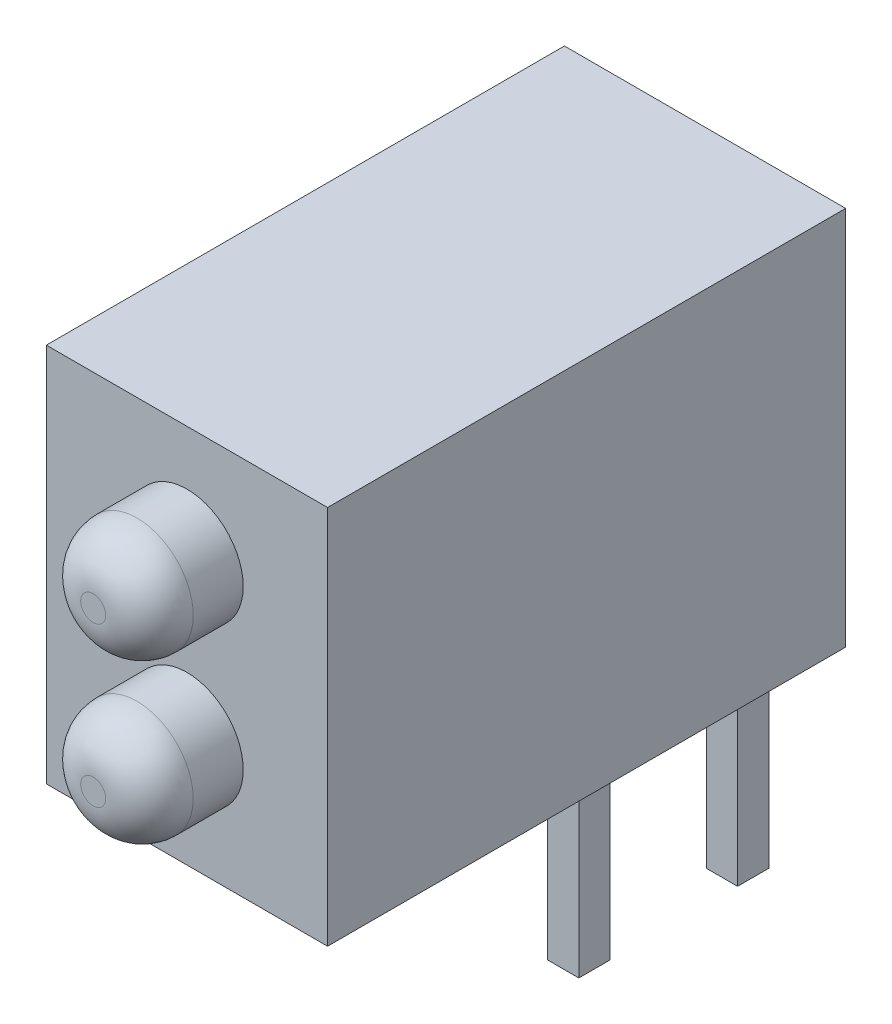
ISO-10303-21;
HEADER;
FILE_DESCRIPTION(('STEP AP214'),'2;1');
FILE_NAME('part.step','',(''),(''),'','','');
FILE_SCHEMA(('AUTOMOTIVE_DESIGN { 1 0 10303 214 1 1 1 1 }'));
ENDSEC;
DATA;
#1=APPLICATION_CONTEXT('core data for automotive mechanical design processes');
#2=APPLICATION_PROTOCOL_DEFINITION('international standard','automotive_design',2000,#1);
#3=PRODUCT_CONTEXT('',#1,'mechanical');
#4=PRODUCT('Part','Part','',(#3));
#5=PRODUCT_RELATED_PRODUCT_CATEGORY('part','',(#4));
#6=PRODUCT_DEFINITION_FORMATION('','',#4);
#7=PRODUCT_DEFINITION_CONTEXT('part definition',#1,'design');
#8=PRODUCT_DEFINITION('design','',#6,#7);
#9=PRODUCT_DEFINITION_SHAPE('','',#8);
#10=(LENGTH_UNIT() NAMED_UNIT(*) SI_UNIT(.MILLI.,.METRE.));
#11=(NAMED_UNIT(*) PLANE_ANGLE_UNIT() SI_UNIT($,.RADIAN.));
#12=(NAMED_UNIT(*) SI_UNIT($,.STERADIAN.) SOLID_ANGLE_UNIT());
#13=UNCERTAINTY_MEASURE_WITH_UNIT(LENGTH_MEASURE(1.E-05),#10,'distance_accuracy_value','');
#14=(GEOMETRIC_REPRESENTATION_CONTEXT(3) GLOBAL_UNCERTAINTY_ASSIGNED_CONTEXT((#13)) GLOBAL_UNIT_ASSIGNED_CONTEXT((#10,
#11,#12)) REPRESENTATION_CONTEXT('',''));
#15=CARTESIAN_POINT('',(0.,0.,0.));
#16=DIRECTION('',(0.,0.,1.));
#17=DIRECTION('',(1.,0.,0.));
#18=AXIS2_PLACEMENT_3D('',#15,#16,#17);
#19=CARTESIAN_POINT('',(-2.25,-3.04,-8.29));
#20=DIRECTION('',(0.,-1.,0.));
#21=DIRECTION('',(0.,0.,-1.));
#22=AXIS2_PLACEMENT_3D('',#19,#20,#21);
#23=PLANE('',#22);
#24=DIRECTION('',(-1.,0.,0.));
#25=VECTOR('',#24,1.);
#26=CARTESIAN_POINT('',(-1.52,-3.04,-4.75));
#27=LINE('',#26,#25);
#28=CARTESIAN_POINT('',(-1.02,-3.04,-4.75));
#29=VERTEX_POINT('',#28);
#30=CARTESIAN_POINT('',(-1.52,-3.04,-4.75));
#31=VERTEX_POINT('',#30);
#32=EDGE_CURVE('E198',#29,#31,#27,.T.);
#33=ORIENTED_EDGE('',*,*,#32,.F.);
#34=DIRECTION('',(0.,0.,1.));
#35=VECTOR('',#34,1.);
#36=CARTESIAN_POINT('',(-1.02,-3.04,-4.75));
#37=LINE('',#36,#35);
#38=CARTESIAN_POINT('',(-1.02,-3.04,-5.25));
#39=VERTEX_POINT('',#38);
#40=EDGE_CURVE('E195',#39,#29,#37,.T.);
#41=ORIENTED_EDGE('',*,*,#40,.F.);
#42=DIRECTION('',(1.,0.,0.));
#43=VECTOR('',#42,1.);
#44=CARTESIAN_POINT('',(-1.52,-3.04,-5.25));
#45=LINE('',#44,#43);
#46=CARTESIAN_POINT('',(-1.52,-3.04,-5.25));
#47=VERTEX_POINT('',#46);
#48=EDGE_CURVE('E207',#47,#39,#45,.T.);
#49=ORIENTED_EDGE('',*,*,#48,.F.);
#50=DIRECTION('',(0.,0.,-1.));
#51=VECTOR('',#50,1.);
#52=CARTESIAN_POINT('',(-1.52,-3.04,-4.75));
#53=LINE('',#52,#51);
#54=EDGE_CURVE('E215',#31,#47,#53,.T.);
#55=ORIENTED_EDGE('',*,*,#54,.F.);
#56=EDGE_LOOP('',(#33,#41,#49,#55));
#57=FACE_BOUND('',#56,.T.);
#58=DIRECTION('',(-1.,0.,0.));
#59=VECTOR('',#58,1.);
#60=CARTESIAN_POINT('',(-1.52,-3.04,-7.29));
#61=LINE('',#60,#59);
#62=CARTESIAN_POINT('',(-1.02,-3.04,-7.29));
#63=VERTEX_POINT('',#62);
#64=CARTESIAN_POINT('',(-1.52,-3.04,-7.29));
#65=VERTEX_POINT('',#64);
#66=EDGE_CURVE('E269',#63,#65,#61,.T.);
#67=ORIENTED_EDGE('',*,*,#66,.F.);
#68=DIRECTION('',(0.,0.,1.));
#69=VECTOR('',#68,1.);
#70=CARTESIAN_POINT('',(-1.02,-3.04,-7.29));
#71=LINE('',#70,#69);
#72=CARTESIAN_POINT('',(-1.02,-3.04,-7.79));
#73=VERTEX_POINT('',#72);
#74=EDGE_CURVE('E255',#73,#63,#71,.T.);
#75=ORIENTED_EDGE('',*,*,#74,.F.);
#76=DIRECTION('',(1.,0.,0.));
#77=VECTOR('',#76,1.);
#78=CARTESIAN_POINT('',(-1.52,-3.04,-7.79));
#79=LINE('',#78,#77);
#80=CARTESIAN_POINT('',(-1.52,-3.04,-7.79));
#81=VERTEX_POINT('',#80);
#82=EDGE_CURVE('E260',#81,#73,#79,.T.);
#83=ORIENTED_EDGE('',*,*,#82,.F.);
#84=DIRECTION('',(0.,0.,-1.));
#85=VECTOR('',#84,1.);
#86=CARTESIAN_POINT('',(-1.52,-3.04,-7.29));
#87=LINE('',#86,#85);
#88=EDGE_CURVE('E271',#65,#81,#87,.T.);
#89=ORIENTED_EDGE('',*,*,#88,.F.);
#90=EDGE_LOOP('',(#67,#75,#83,#89));
#91=FACE_BOUND('',#90,.T.);
#92=DIRECTION('',(1.,0.,0.));
#93=VECTOR('',#92,1.);
#94=CARTESIAN_POINT('',(-2.25,-3.04,0.));
#95=LINE('',#94,#93);
#96=CARTESIAN_POINT('',(-2.25,-3.04,0.));
#97=VERTEX_POINT('',#96);
#98=CARTESIAN_POINT('',(2.25,-3.04,0.));
#99=VERTEX_POINT('',#98);
#100=EDGE_CURVE('E295',#97,#99,#95,.T.);
#101=ORIENTED_EDGE('',*,*,#100,.F.);
#102=DIRECTION('',(0.,0.,1.));
#103=VECTOR('',#102,1.);
#104=CARTESIAN_POINT('',(-2.25,-3.04,-8.29));
#105=LINE('',#104,#103);
#106=CARTESIAN_POINT('',(-2.25,-3.04,-8.29));
#107=VERTEX_POINT('',#106);
#108=EDGE_CURVE('E318',#107,#97,#105,.T.);
#109=ORIENTED_EDGE('',*,*,#108,.F.);
#110=DIRECTION('',(1.,0.,0.));
#111=VECTOR('',#110,1.);
#112=CARTESIAN_POINT('',(-2.25,-3.04,-8.29));
#113=LINE('',#112,#111);
#114=CARTESIAN_POINT('',(2.25,-3.04,-8.29));
#115=VERTEX_POINT('',#114);
#116=EDGE_CURVE('E301',#107,#115,#113,.T.);
#117=ORIENTED_EDGE('',*,*,#116,.T.);
#118=DIRECTION('',(0.,0.,1.));
#119=VECTOR('',#118,1.);
#120=CARTESIAN_POINT('',(2.25,-3.04,-8.29));
#121=LINE('',#120,#119);
#122=EDGE_CURVE('E315',#115,#99,#121,.T.);
#123=ORIENTED_EDGE('',*,*,#122,.T.);
#124=EDGE_LOOP('',(#101,#109,#117,#123));
#125=FACE_BOUND('',#124,.T.);
#126=DIRECTION('',(-1.,0.,0.));
#127=VECTOR('',#126,1.);
#128=CARTESIAN_POINT('',(1.02,-3.04,-7.29));
#129=LINE('',#128,#127);
#130=CARTESIAN_POINT('',(1.52,-3.04,-7.29));
#131=VERTEX_POINT('',#130);
#132=CARTESIAN_POINT('',(1.02,-3.04,-7.29));
#133=VERTEX_POINT('',#132);
#134=EDGE_CURVE('E240',#131,#133,#129,.T.);
#135=ORIENTED_EDGE('',*,*,#134,.F.);
#136=DIRECTION('',(0.,0.,1.));
#137=VECTOR('',#136,1.);
#138=CARTESIAN_POINT('',(1.52,-3.04,-7.29));
#139=LINE('',#138,#137);
#140=CARTESIAN_POINT('',(1.52,-3.04,-7.79));
#141=VERTEX_POINT('',#140);
#142=EDGE_CURVE('E226',#141,#131,#139,.T.);
#143=ORIENTED_EDGE('',*,*,#142,.F.);
#144=DIRECTION('',(1.,0.,0.));
#145=VECTOR('',#144,1.);
#146=CARTESIAN_POINT('',(1.02,-3.04,-7.79));
#147=LINE('',#146,#145);
#148=CARTESIAN_POINT('',(1.02,-3.04,-7.79));
#149=VERTEX_POINT('',#148);
#150=EDGE_CURVE('E231',#149,#141,#147,.T.);
#151=ORIENTED_EDGE('',*,*,#150,.F.);
#152=DIRECTION('',(0.,0.,-1.));
#153=VECTOR('',#152,1.);
#154=CARTESIAN_POINT('',(1.02,-3.04,-7.29));
#155=LINE('',#154,#153);
#156=EDGE_CURVE('E242',#133,#149,#155,.T.);
#157=ORIENTED_EDGE('',*,*,#156,.F.);
#158=EDGE_LOOP('',(#135,#143,#151,#157));
#159=FACE_BOUND('',#158,.T.);
#160=DIRECTION('',(-1.,0.,0.));
#161=VECTOR('',#160,1.);
#162=CARTESIAN_POINT('',(1.02,-3.04,-4.75));
#163=LINE('',#162,#161);
#164=CARTESIAN_POINT('',(1.52,-3.04,-4.75));
#165=VERTEX_POINT('',#164);
#166=CARTESIAN_POINT('',(1.02,-3.04,-4.75));
#167=VERTEX_POINT('',#166);
#168=EDGE_CURVE('E672',#165,#167,#163,.T.);
#169=ORIENTED_EDGE('',*,*,#168,.F.);
#170=DIRECTION('',(0.,0.,1.));
#171=VECTOR('',#170,1.);
#172=CARTESIAN_POINT('',(1.52,-3.04,-4.75));
#173=LINE('',#172,#171);
#174=CARTESIAN_POINT('',(1.52,-3.04,-5.25));
#175=VERTEX_POINT('',#174);
#176=EDGE_CURVE('E193',#175,#165,#173,.T.);
#177=ORIENTED_EDGE('',*,*,#176,.F.);
#178=DIRECTION('',(1.,0.,0.));
#179=VECTOR('',#178,1.);
#180=CARTESIAN_POINT('',(1.02,-3.04,-5.25));
#181=LINE('',#180,#179);
#182=CARTESIAN_POINT('',(1.02,-3.04,-5.25));
#183=VERTEX_POINT('',#182);
#184=EDGE_CURVE('E189',#183,#175,#181,.T.);
#185=ORIENTED_EDGE('',*,*,#184,.F.);
#186=DIRECTION('',(0.,0.,-1.));
#187=VECTOR('',#186,1.);
#188=CARTESIAN_POINT('',(1.02,-3.04,-4.75));
#189=LINE('',#188,#187);
#190=EDGE_CURVE('E669',#167,#183,#189,.T.);
#191=ORIENTED_EDGE('',*,*,#190,.F.);
#192=EDGE_LOOP('',(#169,#177,#185,#191));
#193=FACE_BOUND('',#192,.T.);
#194=ADVANCED_FACE('F32',(#57,#91,#125,#159,#193),#23,.T.);
#195=CARTESIAN_POINT('',(2.25,-3.04,0.));
#196=DIRECTION('',(0.,0.,1.));
#197=DIRECTION('',(1.,0.,0.));
#198=AXIS2_PLACEMENT_3D('',#195,#196,#197);
#199=PLANE('',#198);
#200=CARTESIAN_POINT('',(0.,1.27,0.));
#201=DIRECTION('',(0.,0.,1.));
#202=DIRECTION('',(1.,0.,0.));
#203=AXIS2_PLACEMENT_3D('',#200,#201,#202);
#204=CIRCLE('',#203,0.9);
#205=CARTESIAN_POINT('',(0.9,1.27,0.));
#206=VERTEX_POINT('',#205);
#207=EDGE_CURVE('E287',#206,#206,#204,.T.);
#208=ORIENTED_EDGE('',*,*,#207,.F.);
#209=EDGE_LOOP('',(#208));
#210=FACE_BOUND('',#209,.T.);
#211=DIRECTION('',(0.,1.,0.));
#212=VECTOR('',#211,1.);
#213=CARTESIAN_POINT('',(2.25,3.04,0.));
#214=LINE('',#213,#212);
#215=CARTESIAN_POINT('',(2.25,3.04,0.));
#216=VERTEX_POINT('',#215);
#217=EDGE_CURVE('E290',#99,#216,#214,.T.);
#218=ORIENTED_EDGE('',*,*,#217,.T.);
#219=DIRECTION('',(-1.,0.,0.));
#220=VECTOR('',#219,1.);
#221=CARTESIAN_POINT('',(-2.25,3.04,0.));
#222=LINE('',#221,#220);
#223=CARTESIAN_POINT('',(-2.25,3.04,0.));
#224=VERTEX_POINT('',#223);
#225=EDGE_CURVE('E307',#216,#224,#222,.T.);
#226=ORIENTED_EDGE('',*,*,#225,.T.);
#227=DIRECTION('',(0.,-1.,0.));
#228=VECTOR('',#227,1.);
#229=CARTESIAN_POINT('',(-2.25,3.04,0.));
#230=LINE('',#229,#228);
#231=EDGE_CURVE('E310',#224,#97,#230,.T.);
#232=ORIENTED_EDGE('',*,*,#231,.T.);
#233=ORIENTED_EDGE('',*,*,#100,.T.);
#234=EDGE_LOOP('',(#218,#226,#232,#233));
#235=FACE_BOUND('',#234,.T.);
#236=CARTESIAN_POINT('',(0.,-1.27,0.));
#237=DIRECTION('',(0.,0.,1.));
#238=DIRECTION('',(1.,0.,0.));
#239=AXIS2_PLACEMENT_3D('',#236,#237,#238);
#240=CIRCLE('',#239,0.9);
#241=CARTESIAN_POINT('',(0.9,-1.27,0.));
#242=VERTEX_POINT('',#241);
#243=EDGE_CURVE('E284',#242,#242,#240,.T.);
#244=ORIENTED_EDGE('',*,*,#243,.F.);
#245=EDGE_LOOP('',(#244));
#246=FACE_BOUND('',#245,.T.);
#247=ADVANCED_FACE('F347',(#210,#235,#246),#199,.T.);
#248=CARTESIAN_POINT('',(2.25,3.04,-8.29));
#249=DIRECTION('',(1.,0.,0.));
#250=DIRECTION('',(0.,1.,0.));
#251=AXIS2_PLACEMENT_3D('',#248,#249,#250);
#252=PLANE('',#251);
#253=ORIENTED_EDGE('',*,*,#217,.F.);
#254=ORIENTED_EDGE('',*,*,#122,.F.);
#255=DIRECTION('',(0.,1.,0.));
#256=VECTOR('',#255,1.);
#257=CARTESIAN_POINT('',(2.25,3.04,-8.29));
#258=LINE('',#257,#256);
#259=CARTESIAN_POINT('',(2.25,3.04,-8.29));
#260=VERTEX_POINT('',#259);
#261=EDGE_CURVE('E291',#115,#260,#258,.T.);
#262=ORIENTED_EDGE('',*,*,#261,.T.);
#263=DIRECTION('',(0.,0.,1.));
#264=VECTOR('',#263,1.);
#265=CARTESIAN_POINT('',(2.25,3.04,-8.29));
#266=LINE('',#265,#264);
#267=EDGE_CURVE('E304',#260,#216,#266,.T.);
#268=ORIENTED_EDGE('',*,*,#267,.T.);
#269=EDGE_LOOP('',(#253,#254,#262,#268));
#270=FACE_BOUND('',#269,.T.);
#271=ADVANCED_FACE('F353',(#270),#252,.T.);
#272=CARTESIAN_POINT('',(-2.25,3.04,-8.29));
#273=DIRECTION('',(-1.,0.,0.));
#274=DIRECTION('',(0.,-1.,0.));
#275=AXIS2_PLACEMENT_3D('',#272,#273,#274);
#276=PLANE('',#275);
#277=ORIENTED_EDGE('',*,*,#231,.F.);
#278=DIRECTION('',(0.,0.,1.));
#279=VECTOR('',#278,1.);
#280=CARTESIAN_POINT('',(-2.25,3.04,-8.29));
#281=LINE('',#280,#279);
#282=CARTESIAN_POINT('',(-2.25,3.04,-8.29));
#283=VERTEX_POINT('',#282);
#284=EDGE_CURVE('E320',#283,#224,#281,.T.);
#285=ORIENTED_EDGE('',*,*,#284,.F.);
#286=DIRECTION('',(0.,-1.,0.));
#287=VECTOR('',#286,1.);
#288=CARTESIAN_POINT('',(-2.25,3.04,-8.29));
#289=LINE('',#288,#287);
#290=EDGE_CURVE('E298',#283,#107,#289,.T.);
#291=ORIENTED_EDGE('',*,*,#290,.T.);
#292=ORIENTED_EDGE('',*,*,#108,.T.);
#293=EDGE_LOOP('',(#277,#285,#291,#292));
#294=FACE_BOUND('',#293,.T.);
#295=ADVANCED_FACE('F360',(#294),#276,.T.);
#296=CARTESIAN_POINT('',(-2.25,3.04,-8.29));
#297=DIRECTION('',(0.,1.,0.));
#298=DIRECTION('',(0.,0.,1.));
#299=AXIS2_PLACEMENT_3D('',#296,#297,#298);
#300=PLANE('',#299);
#301=ORIENTED_EDGE('',*,*,#225,.F.);
#302=ORIENTED_EDGE('',*,*,#267,.F.);
#303=DIRECTION('',(-1.,0.,0.));
#304=VECTOR('',#303,1.);
#305=CARTESIAN_POINT('',(-2.25,3.04,-8.29));
#306=LINE('',#305,#304);
#307=EDGE_CURVE('E294',#260,#283,#306,.T.);
#308=ORIENTED_EDGE('',*,*,#307,.T.);
#309=ORIENTED_EDGE('',*,*,#284,.T.);
#310=EDGE_LOOP('',(#301,#302,#308,#309));
#311=FACE_BOUND('',#310,.T.);
#312=ADVANCED_FACE('F363',(#311),#300,.T.);
#313=CARTESIAN_POINT('',(2.25,-3.04,-8.29));
#314=DIRECTION('',(0.,0.,1.));
#315=DIRECTION('',(1.,0.,0.));
#316=AXIS2_PLACEMENT_3D('',#313,#314,#315);
#317=PLANE('',#316);
#318=ORIENTED_EDGE('',*,*,#261,.F.);
#319=ORIENTED_EDGE('',*,*,#116,.F.);
#320=ORIENTED_EDGE('',*,*,#290,.F.);
#321=ORIENTED_EDGE('',*,*,#307,.F.);
#322=EDGE_LOOP('',(#318,#319,#320,#321));
#323=FACE_BOUND('',#322,.T.);
#324=ADVANCED_FACE('F367',(#323),#317,.F.);
#325=CARTESIAN_POINT('',(0.,1.27,1.5));
#326=DIRECTION('',(0.,0.,-1.));
#327=DIRECTION('',(-1.,0.,0.));
#328=AXIS2_PLACEMENT_3D('',#325,#326,#327);
#329=CYLINDRICAL_SURFACE('',#328,0.9);
#330=CARTESIAN_POINT('',(0.,1.27,0.8));
#331=DIRECTION('',(0.,0.,1.));
#332=DIRECTION('',(1.,0.,0.));
#333=AXIS2_PLACEMENT_3D('',#330,#331,#332);
#334=CIRCLE('',#333,0.9);
#335=CARTESIAN_POINT('',(0.9,1.27,0.8));
#336=VERTEX_POINT('',#335);
#337=EDGE_CURVE('E11',#336,#336,#334,.F.);
#338=ORIENTED_EDGE('',*,*,#337,.T.);
#339=EDGE_LOOP('',(#338));
#340=FACE_BOUND('',#339,.T.);
#341=ORIENTED_EDGE('',*,*,#207,.T.);
#342=EDGE_LOOP('',(#341));
#343=FACE_BOUND('',#342,.T.);
#344=ADVANCED_FACE('F387',(#340,#343),#329,.T.);
#345=CARTESIAN_POINT('',(0.,1.27,1.5));
#346=DIRECTION('',(0.,0.,1.));
#347=DIRECTION('',(1.,0.,0.));
#348=AXIS2_PLACEMENT_3D('',#345,#346,#347);
#349=PLANE('',#348);
#350=CARTESIAN_POINT('',(0.,1.27,1.5));
#351=DIRECTION('',(0.,0.,1.));
#352=DIRECTION('',(1.,0.,0.));
#353=AXIS2_PLACEMENT_3D('',#350,#351,#352);
#354=CIRCLE('',#353,0.2);
#355=CARTESIAN_POINT('',(0.2,1.27,1.5));
#356=VERTEX_POINT('',#355);
#357=EDGE_CURVE('E40',#356,#356,#354,.T.);
#358=ORIENTED_EDGE('',*,*,#357,.T.);
#359=EDGE_LOOP('',(#358));
#360=FACE_BOUND('',#359,.T.);
#361=ADVANCED_FACE('F330',(#360),#349,.T.);
#362=CARTESIAN_POINT('',(0.,-1.27,1.5));
#363=DIRECTION('',(0.,0.,-1.));
#364=DIRECTION('',(-1.,0.,0.));
#365=AXIS2_PLACEMENT_3D('',#362,#363,#364);
#366=CYLINDRICAL_SURFACE('',#365,0.9);
#367=CARTESIAN_POINT('',(0.,-1.27,0.8));
#368=DIRECTION('',(0.,0.,1.));
#369=DIRECTION('',(1.,0.,0.));
#370=AXIS2_PLACEMENT_3D('',#367,#368,#369);
#371=CIRCLE('',#370,0.9);
#372=CARTESIAN_POINT('',(0.9,-1.27,0.8));
#373=VERTEX_POINT('',#372);
#374=EDGE_CURVE('E325',#373,#373,#371,.F.);
#375=ORIENTED_EDGE('',*,*,#374,.T.);
#376=EDGE_LOOP('',(#375));
#377=FACE_BOUND('',#376,.T.);
#378=ORIENTED_EDGE('',*,*,#243,.T.);
#379=EDGE_LOOP('',(#378));
#380=FACE_BOUND('',#379,.T.);
#381=ADVANCED_FACE('F396',(#377,#380),#366,.T.);
#382=CARTESIAN_POINT('',(0.,-1.27,1.5));
#383=DIRECTION('',(0.,0.,1.));
#384=DIRECTION('',(1.,0.,0.));
#385=AXIS2_PLACEMENT_3D('',#382,#383,#384);
#386=PLANE('',#385);
#387=CARTESIAN_POINT('',(0.,-1.27,1.5));
#388=DIRECTION('',(0.,0.,1.));
#389=DIRECTION('',(1.,0.,0.));
#390=AXIS2_PLACEMENT_3D('',#387,#388,#389);
#391=CIRCLE('',#390,0.2);
#392=CARTESIAN_POINT('',(0.2,-1.27,1.5));
#393=VERTEX_POINT('',#392);
#394=EDGE_CURVE('E317',#393,#393,#391,.T.);
#395=ORIENTED_EDGE('',*,*,#394,.T.);
#396=EDGE_LOOP('',(#395));
#397=FACE_BOUND('',#396,.T.);
#398=ADVANCED_FACE('F343',(#397),#386,.T.);
#399=CARTESIAN_POINT('',(0.,-1.27,0.8));
#400=DIRECTION('',(0.,0.,1.));
#401=DIRECTION('',(1.,0.,0.));
#402=AXIS2_PLACEMENT_3D('',#399,#400,#401);
#403=DEGENERATE_TOROIDAL_SURFACE('',#402,0.2,0.7,.T.);
#404=ORIENTED_EDGE('',*,*,#374,.F.);
#405=EDGE_LOOP('',(#404));
#406=FACE_BOUND('',#405,.T.);
#407=ORIENTED_EDGE('',*,*,#394,.F.);
#408=EDGE_LOOP('',(#407));
#409=FACE_BOUND('',#408,.T.);
#410=ADVANCED_FACE('F334',(#406,#409),#403,.T.);
#411=CARTESIAN_POINT('',(0.,1.27,0.8));
#412=DIRECTION('',(0.,0.,1.));
#413=DIRECTION('',(1.,0.,0.));
#414=AXIS2_PLACEMENT_3D('',#411,#412,#413);
#415=DEGENERATE_TOROIDAL_SURFACE('',#414,0.2,0.7,.T.);
#416=ORIENTED_EDGE('',*,*,#337,.F.);
#417=EDGE_LOOP('',(#416));
#418=FACE_BOUND('',#417,.T.);
#419=ORIENTED_EDGE('',*,*,#357,.F.);
#420=EDGE_LOOP('',(#419));
#421=FACE_BOUND('',#420,.T.);
#422=ADVANCED_FACE('F34',(#418,#421),#415,.T.);
#423=CARTESIAN_POINT('',(-1.02,-6.22,-7.29));
#424=DIRECTION('',(-1.,0.,0.));
#425=DIRECTION('',(0.,0.,1.));
#426=AXIS2_PLACEMENT_3D('',#423,#424,#425);
#427=PLANE('',#426);
#428=ORIENTED_EDGE('',*,*,#74,.T.);
#429=DIRECTION('',(0.,1.,0.));
#430=VECTOR('',#429,1.);
#431=CARTESIAN_POINT('',(-1.02,-6.22,-7.29));
#432=LINE('',#431,#430);
#433=CARTESIAN_POINT('',(-1.02,-6.22,-7.29));
#434=VERTEX_POINT('',#433);
#435=EDGE_CURVE('E282',#434,#63,#432,.T.);
#436=ORIENTED_EDGE('',*,*,#435,.F.);
#437=DIRECTION('',(0.,0.,1.));
#438=VECTOR('',#437,1.);
#439=CARTESIAN_POINT('',(-1.02,-6.22,-7.29));
#440=LINE('',#439,#438);
#441=CARTESIAN_POINT('',(-1.02,-6.22,-7.79));
#442=VERTEX_POINT('',#441);
#443=EDGE_CURVE('E256',#442,#434,#440,.T.);
#444=ORIENTED_EDGE('',*,*,#443,.F.);
#445=DIRECTION('',(0.,1.,0.));
#446=VECTOR('',#445,1.);
#447=CARTESIAN_POINT('',(-1.02,-6.22,-7.79));
#448=LINE('',#447,#446);
#449=EDGE_CURVE('E266',#442,#73,#448,.T.);
#450=ORIENTED_EDGE('',*,*,#449,.T.);
#451=EDGE_LOOP('',(#428,#436,#444,#450));
#452=FACE_BOUND('',#451,.T.);
#453=ADVANCED_FACE('F333',(#452),#427,.F.);
#454=CARTESIAN_POINT('',(-1.52,-6.22,-7.29));
#455=DIRECTION('',(0.,0.,-1.));
#456=DIRECTION('',(-1.,0.,0.));
#457=AXIS2_PLACEMENT_3D('',#454,#455,#456);
#458=PLANE('',#457);
#459=ORIENTED_EDGE('',*,*,#66,.T.);
#460=DIRECTION('',(0.,1.,0.));
#461=VECTOR('',#460,1.);
#462=CARTESIAN_POINT('',(-1.52,-6.22,-7.29));
#463=LINE('',#462,#461);
#464=CARTESIAN_POINT('',(-1.52,-6.22,-7.29));
#465=VERTEX_POINT('',#464);
#466=EDGE_CURVE('E279',#465,#65,#463,.T.);
#467=ORIENTED_EDGE('',*,*,#466,.F.);
#468=DIRECTION('',(-1.,0.,0.));
#469=VECTOR('',#468,1.);
#470=CARTESIAN_POINT('',(-1.52,-6.22,-7.29));
#471=LINE('',#470,#469);
#472=EDGE_CURVE('E259',#434,#465,#471,.T.);
#473=ORIENTED_EDGE('',*,*,#472,.F.);
#474=ORIENTED_EDGE('',*,*,#435,.T.);
#475=EDGE_LOOP('',(#459,#467,#473,#474));
#476=FACE_BOUND('',#475,.T.);
#477=ADVANCED_FACE('F340',(#476),#458,.F.);
#478=CARTESIAN_POINT('',(-1.52,-6.22,-7.29));
#479=DIRECTION('',(1.,0.,0.));
#480=DIRECTION('',(0.,0.,-1.));
#481=AXIS2_PLACEMENT_3D('',#478,#479,#480);
#482=PLANE('',#481);
#483=ORIENTED_EDGE('',*,*,#88,.T.);
#484=DIRECTION('',(0.,1.,0.));
#485=VECTOR('',#484,1.);
#486=CARTESIAN_POINT('',(-1.52,-6.22,-7.79));
#487=LINE('',#486,#485);
#488=CARTESIAN_POINT('',(-1.52,-6.22,-7.79));
#489=VERTEX_POINT('',#488);
#490=EDGE_CURVE('E277',#489,#81,#487,.T.);
#491=ORIENTED_EDGE('',*,*,#490,.F.);
#492=DIRECTION('',(0.,0.,-1.));
#493=VECTOR('',#492,1.);
#494=CARTESIAN_POINT('',(-1.52,-6.22,-7.29));
#495=LINE('',#494,#493);
#496=EDGE_CURVE('E262',#465,#489,#495,.T.);
#497=ORIENTED_EDGE('',*,*,#496,.F.);
#498=ORIENTED_EDGE('',*,*,#466,.T.);
#499=EDGE_LOOP('',(#483,#491,#497,#498));
#500=FACE_BOUND('',#499,.T.);
#501=ADVANCED_FACE('F405',(#500),#482,.F.);
#502=CARTESIAN_POINT('',(-1.52,-6.22,-7.79));
#503=DIRECTION('',(0.,0.,1.));
#504=DIRECTION('',(1.,0.,0.));
#505=AXIS2_PLACEMENT_3D('',#502,#503,#504);
#506=PLANE('',#505);
#507=ORIENTED_EDGE('',*,*,#82,.T.);
#508=ORIENTED_EDGE('',*,*,#449,.F.);
#509=DIRECTION('',(1.,0.,0.));
#510=VECTOR('',#509,1.);
#511=CARTESIAN_POINT('',(-1.52,-6.22,-7.79));
#512=LINE('',#511,#510);
#513=EDGE_CURVE('E264',#489,#442,#512,.T.);
#514=ORIENTED_EDGE('',*,*,#513,.F.);
#515=ORIENTED_EDGE('',*,*,#490,.T.);
#516=EDGE_LOOP('',(#507,#508,#514,#515));
#517=FACE_BOUND('',#516,.T.);
#518=ADVANCED_FACE('F409',(#517),#506,.F.);
#519=CARTESIAN_POINT('',(-1.02,-6.22,-7.79));
#520=DIRECTION('',(0.,-1.,0.));
#521=DIRECTION('',(0.,0.,-1.));
#522=AXIS2_PLACEMENT_3D('',#519,#520,#521);
#523=PLANE('',#522);
#524=ORIENTED_EDGE('',*,*,#443,.T.);
#525=ORIENTED_EDGE('',*,*,#472,.T.);
#526=ORIENTED_EDGE('',*,*,#496,.T.);
#527=ORIENTED_EDGE('',*,*,#513,.T.);
#528=EDGE_LOOP('',(#524,#525,#526,#527));
#529=FACE_BOUND('',#528,.T.);
#530=ADVANCED_FACE('F413',(#529),#523,.T.);
#531=CARTESIAN_POINT('',(1.52,-6.22,-7.29));
#532=DIRECTION('',(-1.,0.,0.));
#533=DIRECTION('',(0.,0.,1.));
#534=AXIS2_PLACEMENT_3D('',#531,#532,#533);
#535=PLANE('',#534);
#536=ORIENTED_EDGE('',*,*,#142,.T.);
#537=DIRECTION('',(0.,1.,0.));
#538=VECTOR('',#537,1.);
#539=CARTESIAN_POINT('',(1.52,-6.22,-7.29));
#540=LINE('',#539,#538);
#541=CARTESIAN_POINT('',(1.52,-6.22,-7.29));
#542=VERTEX_POINT('',#541);
#543=EDGE_CURVE('E253',#542,#131,#540,.T.);
#544=ORIENTED_EDGE('',*,*,#543,.F.);
#545=DIRECTION('',(0.,0.,1.));
#546=VECTOR('',#545,1.);
#547=CARTESIAN_POINT('',(1.52,-6.22,-7.29));
#548=LINE('',#547,#546);
#549=CARTESIAN_POINT('',(1.52,-6.22,-7.79));
#550=VERTEX_POINT('',#549);
#551=EDGE_CURVE('E227',#550,#542,#548,.T.);
#552=ORIENTED_EDGE('',*,*,#551,.F.);
#553=DIRECTION('',(0.,1.,0.));
#554=VECTOR('',#553,1.);
#555=CARTESIAN_POINT('',(1.52,-6.22,-7.79));
#556=LINE('',#555,#554);
#557=EDGE_CURVE('E237',#550,#141,#556,.T.);
#558=ORIENTED_EDGE('',*,*,#557,.T.);
#559=EDGE_LOOP('',(#536,#544,#552,#558));
#560=FACE_BOUND('',#559,.T.);
#561=ADVANCED_FACE('F417',(#560),#535,.F.);
#562=CARTESIAN_POINT('',(1.02,-6.22,-7.29));
#563=DIRECTION('',(0.,0.,-1.));
#564=DIRECTION('',(-1.,0.,0.));
#565=AXIS2_PLACEMENT_3D('',#562,#563,#564);
#566=PLANE('',#565);
#567=ORIENTED_EDGE('',*,*,#134,.T.);
#568=DIRECTION('',(0.,1.,0.));
#569=VECTOR('',#568,1.);
#570=CARTESIAN_POINT('',(1.02,-6.22,-7.29));
#571=LINE('',#570,#569);
#572=CARTESIAN_POINT('',(1.02,-6.22,-7.29));
#573=VERTEX_POINT('',#572);
#574=EDGE_CURVE('E250',#573,#133,#571,.T.);
#575=ORIENTED_EDGE('',*,*,#574,.F.);
#576=DIRECTION('',(-1.,0.,0.));
#577=VECTOR('',#576,1.);
#578=CARTESIAN_POINT('',(1.02,-6.22,-7.29));
#579=LINE('',#578,#577);
#580=EDGE_CURVE('E230',#542,#573,#579,.T.);
#581=ORIENTED_EDGE('',*,*,#580,.F.);
#582=ORIENTED_EDGE('',*,*,#543,.T.);
#583=EDGE_LOOP('',(#567,#575,#581,#582));
#584=FACE_BOUND('',#583,.T.);
#585=ADVANCED_FACE('F421',(#584),#566,.F.);
#586=CARTESIAN_POINT('',(1.02,-6.22,-7.29));
#587=DIRECTION('',(1.,0.,0.));
#588=DIRECTION('',(0.,0.,-1.));
#589=AXIS2_PLACEMENT_3D('',#586,#587,#588);
#590=PLANE('',#589);
#591=ORIENTED_EDGE('',*,*,#156,.T.);
#592=DIRECTION('',(0.,1.,0.));
#593=VECTOR('',#592,1.);
#594=CARTESIAN_POINT('',(1.02,-6.22,-7.79));
#595=LINE('',#594,#593);
#596=CARTESIAN_POINT('',(1.02,-6.22,-7.79));
#597=VERTEX_POINT('',#596);
#598=EDGE_CURVE('E248',#597,#149,#595,.T.);
#599=ORIENTED_EDGE('',*,*,#598,.F.);
#600=DIRECTION('',(0.,0.,-1.));
#601=VECTOR('',#600,1.);
#602=CARTESIAN_POINT('',(1.02,-6.22,-7.29));
#603=LINE('',#602,#601);
#604=EDGE_CURVE('E233',#573,#597,#603,.T.);
#605=ORIENTED_EDGE('',*,*,#604,.F.);
#606=ORIENTED_EDGE('',*,*,#574,.T.);
#607=EDGE_LOOP('',(#591,#599,#605,#606));
#608=FACE_BOUND('',#607,.T.);
#609=ADVANCED_FACE('F425',(#608),#590,.F.);
#610=CARTESIAN_POINT('',(1.02,-6.22,-7.79));
#611=DIRECTION('',(0.,0.,1.));
#612=DIRECTION('',(1.,0.,0.));
#613=AXIS2_PLACEMENT_3D('',#610,#611,#612);
#614=PLANE('',#613);
#615=ORIENTED_EDGE('',*,*,#150,.T.);
#616=ORIENTED_EDGE('',*,*,#557,.F.);
#617=DIRECTION('',(1.,0.,0.));
#618=VECTOR('',#617,1.);
#619=CARTESIAN_POINT('',(1.02,-6.22,-7.79));
#620=LINE('',#619,#618);
#621=EDGE_CURVE('E235',#597,#550,#620,.T.);
#622=ORIENTED_EDGE('',*,*,#621,.F.);
#623=ORIENTED_EDGE('',*,*,#598,.T.);
#624=EDGE_LOOP('',(#615,#616,#622,#623));
#625=FACE_BOUND('',#624,.T.);
#626=ADVANCED_FACE('F429',(#625),#614,.F.);
#627=CARTESIAN_POINT('',(1.52,-6.22,-7.79));
#628=DIRECTION('',(0.,-1.,0.));
#629=DIRECTION('',(0.,0.,-1.));
#630=AXIS2_PLACEMENT_3D('',#627,#628,#629);
#631=PLANE('',#630);
#632=ORIENTED_EDGE('',*,*,#551,.T.);
#633=ORIENTED_EDGE('',*,*,#580,.T.);
#634=ORIENTED_EDGE('',*,*,#604,.T.);
#635=ORIENTED_EDGE('',*,*,#621,.T.);
#636=EDGE_LOOP('',(#632,#633,#634,#635));
#637=FACE_BOUND('',#636,.T.);
#638=ADVANCED_FACE('F433',(#637),#631,.T.);
#639=CARTESIAN_POINT('',(-1.02,-6.22,-4.75));
#640=DIRECTION('',(-1.,0.,0.));
#641=DIRECTION('',(0.,0.,1.));
#642=AXIS2_PLACEMENT_3D('',#639,#640,#641);
#643=PLANE('',#642);
#644=ORIENTED_EDGE('',*,*,#40,.T.);
#645=DIRECTION('',(0.,1.,0.));
#646=VECTOR('',#645,1.);
#647=CARTESIAN_POINT('',(-1.02,-6.22,-4.75));
#648=LINE('',#647,#646);
#649=CARTESIAN_POINT('',(-1.02,-6.22,-4.75));
#650=VERTEX_POINT('',#649);
#651=EDGE_CURVE('E224',#650,#29,#648,.T.);
#652=ORIENTED_EDGE('',*,*,#651,.F.);
#653=DIRECTION('',(0.,0.,1.));
#654=VECTOR('',#653,1.);
#655=CARTESIAN_POINT('',(-1.02,-6.22,-4.75));
#656=LINE('',#655,#654);
#657=CARTESIAN_POINT('',(-1.02,-6.22,-5.25));
#658=VERTEX_POINT('',#657);
#659=EDGE_CURVE('E203',#658,#650,#656,.T.);
#660=ORIENTED_EDGE('',*,*,#659,.F.);
#661=DIRECTION('',(0.,1.,0.));
#662=VECTOR('',#661,1.);
#663=CARTESIAN_POINT('',(-1.02,-6.22,-5.25));
#664=LINE('',#663,#662);
#665=EDGE_CURVE('E212',#658,#39,#664,.T.);
#666=ORIENTED_EDGE('',*,*,#665,.T.);
#667=EDGE_LOOP('',(#644,#652,#660,#666));
#668=FACE_BOUND('',#667,.T.);
#669=ADVANCED_FACE('F437',(#668),#643,.F.);
#670=CARTESIAN_POINT('',(-1.52,-6.22,-4.75));
#671=DIRECTION('',(0.,0.,-1.));
#672=DIRECTION('',(-1.,0.,0.));
#673=AXIS2_PLACEMENT_3D('',#670,#671,#672);
#674=PLANE('',#673);
#675=ORIENTED_EDGE('',*,*,#32,.T.);
#676=DIRECTION('',(0.,1.,0.));
#677=VECTOR('',#676,1.);
#678=CARTESIAN_POINT('',(-1.52,-6.22,-4.75));
#679=LINE('',#678,#677);
#680=CARTESIAN_POINT('',(-1.52,-6.22,-4.75));
#681=VERTEX_POINT('',#680);
#682=EDGE_CURVE('E221',#681,#31,#679,.T.);
#683=ORIENTED_EDGE('',*,*,#682,.F.);
#684=DIRECTION('',(-1.,0.,0.));
#685=VECTOR('',#684,1.);
#686=CARTESIAN_POINT('',(-1.52,-6.22,-4.75));
#687=LINE('',#686,#685);
#688=EDGE_CURVE('E206',#650,#681,#687,.T.);
#689=ORIENTED_EDGE('',*,*,#688,.F.);
#690=ORIENTED_EDGE('',*,*,#651,.T.);
#691=EDGE_LOOP('',(#675,#683,#689,#690));
#692=FACE_BOUND('',#691,.T.);
#693=ADVANCED_FACE('F441',(#692),#674,.F.);
#694=CARTESIAN_POINT('',(-1.52,-6.22,-4.75));
#695=DIRECTION('',(1.,0.,0.));
#696=DIRECTION('',(0.,0.,-1.));
#697=AXIS2_PLACEMENT_3D('',#694,#695,#696);
#698=PLANE('',#697);
#699=ORIENTED_EDGE('',*,*,#54,.T.);
#700=DIRECTION('',(0.,1.,0.));
#701=VECTOR('',#700,1.);
#702=CARTESIAN_POINT('',(-1.52,-6.22,-5.25));
#703=LINE('',#702,#701);
#704=CARTESIAN_POINT('',(-1.52,-6.22,-5.25));
#705=VERTEX_POINT('',#704);
#706=EDGE_CURVE('E55',#705,#47,#703,.T.);
#707=ORIENTED_EDGE('',*,*,#706,.F.);
#708=DIRECTION('',(0.,0.,-1.));
#709=VECTOR('',#708,1.);
#710=CARTESIAN_POINT('',(-1.52,-6.22,-4.75));
#711=LINE('',#710,#709);
#712=EDGE_CURVE('E209',#681,#705,#711,.T.);
#713=ORIENTED_EDGE('',*,*,#712,.F.);
#714=ORIENTED_EDGE('',*,*,#682,.T.);
#715=EDGE_LOOP('',(#699,#707,#713,#714));
#716=FACE_BOUND('',#715,.T.);
#717=ADVANCED_FACE('F445',(#716),#698,.F.);
#718=CARTESIAN_POINT('',(-1.52,-6.22,-5.25));
#719=DIRECTION('',(0.,0.,1.));
#720=DIRECTION('',(1.,0.,0.));
#721=AXIS2_PLACEMENT_3D('',#718,#719,#720);
#722=PLANE('',#721);
#723=ORIENTED_EDGE('',*,*,#48,.T.);
#724=ORIENTED_EDGE('',*,*,#665,.F.);
#725=DIRECTION('',(1.,0.,0.));
#726=VECTOR('',#725,1.);
#727=CARTESIAN_POINT('',(-1.52,-6.22,-5.25));
#728=LINE('',#727,#726);
#729=EDGE_CURVE('E211',#705,#658,#728,.T.);
#730=ORIENTED_EDGE('',*,*,#729,.F.);
#731=ORIENTED_EDGE('',*,*,#706,.T.);
#732=EDGE_LOOP('',(#723,#724,#730,#731));
#733=FACE_BOUND('',#732,.T.);
#734=ADVANCED_FACE('F449',(#733),#722,.F.);
#735=CARTESIAN_POINT('',(-1.02,-6.22,-5.25));
#736=DIRECTION('',(0.,-1.,0.));
#737=DIRECTION('',(0.,0.,-1.));
#738=AXIS2_PLACEMENT_3D('',#735,#736,#737);
#739=PLANE('',#738);
#740=ORIENTED_EDGE('',*,*,#659,.T.);
#741=ORIENTED_EDGE('',*,*,#688,.T.);
#742=ORIENTED_EDGE('',*,*,#712,.T.);
#743=ORIENTED_EDGE('',*,*,#729,.T.);
#744=EDGE_LOOP('',(#740,#741,#742,#743));
#745=FACE_BOUND('',#744,.T.);
#746=ADVANCED_FACE('F453',(#745),#739,.T.);
#747=CARTESIAN_POINT('',(1.52,-6.22,-4.75));
#748=DIRECTION('',(-1.,0.,0.));
#749=DIRECTION('',(0.,0.,1.));
#750=AXIS2_PLACEMENT_3D('',#747,#748,#749);
#751=PLANE('',#750);
#752=ORIENTED_EDGE('',*,*,#176,.T.);
#753=DIRECTION('',(0.,1.,0.));
#754=VECTOR('',#753,1.);
#755=CARTESIAN_POINT('',(1.52,-6.22,-4.75));
#756=LINE('',#755,#754);
#757=CARTESIAN_POINT('',(1.52,-6.22,-4.75));
#758=VERTEX_POINT('',#757);
#759=EDGE_CURVE('E174',#758,#165,#756,.T.);
#760=ORIENTED_EDGE('',*,*,#759,.F.);
#761=DIRECTION('',(0.,0.,1.));
#762=VECTOR('',#761,1.);
#763=CARTESIAN_POINT('',(1.52,-6.22,-4.75));
#764=LINE('',#763,#762);
#765=CARTESIAN_POINT('',(1.52,-6.22,-5.25));
#766=VERTEX_POINT('',#765);
#767=EDGE_CURVE('E181',#766,#758,#764,.T.);
#768=ORIENTED_EDGE('',*,*,#767,.F.);
#769=DIRECTION('',(0.,1.,0.));
#770=VECTOR('',#769,1.);
#771=CARTESIAN_POINT('',(1.52,-6.22,-5.25));
#772=LINE('',#771,#770);
#773=EDGE_CURVE('E666',#766,#175,#772,.T.);
#774=ORIENTED_EDGE('',*,*,#773,.T.);
#775=EDGE_LOOP('',(#752,#760,#768,#774));
#776=FACE_BOUND('',#775,.T.);
#777=ADVANCED_FACE('F191',(#776),#751,.F.);
#778=CARTESIAN_POINT('',(1.02,-6.22,-4.75));
#779=DIRECTION('',(0.,0.,-1.));
#780=DIRECTION('',(-1.,0.,0.));
#781=AXIS2_PLACEMENT_3D('',#778,#779,#780);
#782=PLANE('',#781);
#783=ORIENTED_EDGE('',*,*,#168,.T.);
#784=DIRECTION('',(0.,1.,0.));
#785=VECTOR('',#784,1.);
#786=CARTESIAN_POINT('',(1.02,-6.22,-4.75));
#787=LINE('',#786,#785);
#788=CARTESIAN_POINT('',(1.02,-6.22,-4.75));
#789=VERTEX_POINT('',#788);
#790=EDGE_CURVE('E177',#789,#167,#787,.T.);
#791=ORIENTED_EDGE('',*,*,#790,.F.);
#792=DIRECTION('',(-1.,0.,0.));
#793=VECTOR('',#792,1.);
#794=CARTESIAN_POINT('',(1.02,-6.22,-4.75));
#795=LINE('',#794,#793);
#796=EDGE_CURVE('E170',#758,#789,#795,.T.);
#797=ORIENTED_EDGE('',*,*,#796,.F.);
#798=ORIENTED_EDGE('',*,*,#759,.T.);
#799=EDGE_LOOP('',(#783,#791,#797,#798));
#800=FACE_BOUND('',#799,.T.);
#801=ADVANCED_FACE('F172',(#800),#782,.F.);
#802=CARTESIAN_POINT('',(1.02,-6.22,-4.75));
#803=DIRECTION('',(1.,0.,0.));
#804=DIRECTION('',(0.,0.,-1.));
#805=AXIS2_PLACEMENT_3D('',#802,#803,#804);
#806=PLANE('',#805);
#807=ORIENTED_EDGE('',*,*,#190,.T.);
#808=DIRECTION('',(0.,1.,0.));
#809=VECTOR('',#808,1.);
#810=CARTESIAN_POINT('',(1.02,-6.22,-5.25));
#811=LINE('',#810,#809);
#812=CARTESIAN_POINT('',(1.02,-6.22,-5.25));
#813=VERTEX_POINT('',#812);
#814=EDGE_CURVE('E47',#813,#183,#811,.T.);
#815=ORIENTED_EDGE('',*,*,#814,.F.);
#816=DIRECTION('',(0.,0.,-1.));
#817=VECTOR('',#816,1.);
#818=CARTESIAN_POINT('',(1.02,-6.22,-4.75));
#819=LINE('',#818,#817);
#820=EDGE_CURVE('E180',#789,#813,#819,.T.);
#821=ORIENTED_EDGE('',*,*,#820,.F.);
#822=ORIENTED_EDGE('',*,*,#790,.T.);
#823=EDGE_LOOP('',(#807,#815,#821,#822));
#824=FACE_BOUND('',#823,.T.);
#825=ADVANCED_FACE('F461',(#824),#806,.F.);
#826=CARTESIAN_POINT('',(1.02,-6.22,-5.25));
#827=DIRECTION('',(0.,0.,1.));
#828=DIRECTION('',(1.,0.,0.));
#829=AXIS2_PLACEMENT_3D('',#826,#827,#828);
#830=PLANE('',#829);
#831=ORIENTED_EDGE('',*,*,#184,.T.);
#832=ORIENTED_EDGE('',*,*,#773,.F.);
#833=DIRECTION('',(1.,0.,0.));
#834=VECTOR('',#833,1.);
#835=CARTESIAN_POINT('',(1.02,-6.22,-5.25));
#836=LINE('',#835,#834);
#837=EDGE_CURVE('E185',#813,#766,#836,.T.);
#838=ORIENTED_EDGE('',*,*,#837,.F.);
#839=ORIENTED_EDGE('',*,*,#814,.T.);
#840=EDGE_LOOP('',(#831,#832,#838,#839));
#841=FACE_BOUND('',#840,.T.);
#842=ADVANCED_FACE('F464',(#841),#830,.F.);
#843=CARTESIAN_POINT('',(1.52,-6.22,-5.25));
#844=DIRECTION('',(0.,-1.,0.));
#845=DIRECTION('',(0.,0.,-1.));
#846=AXIS2_PLACEMENT_3D('',#843,#844,#845);
#847=PLANE('',#846);
#848=ORIENTED_EDGE('',*,*,#767,.T.);
#849=ORIENTED_EDGE('',*,*,#796,.T.);
#850=ORIENTED_EDGE('',*,*,#820,.T.);
#851=ORIENTED_EDGE('',*,*,#837,.T.);
#852=EDGE_LOOP('',(#848,#849,#850,#851));
#853=FACE_BOUND('',#852,.T.);
#854=ADVANCED_FACE('F184',(#853),#847,.T.);
#855=CLOSED_SHELL('',(#194,#247,#271,#295,#312,#324,#344,#361,#381,#398,#410,#422,#453,#477,
#501,#518,#530,#561,#585,#609,#626,#638,#669,#693,#717,#734,#746,#777,#801,#825,#842,#854));
#856=MANIFOLD_SOLID_BREP('B2',#855);
#857=ADVANCED_BREP_SHAPE_REPRESENTATION('',(#18,#856),#14);
#858=SHAPE_DEFINITION_REPRESENTATION(#9,#857);
ENDSEC;
END-ISO-10303-21;
